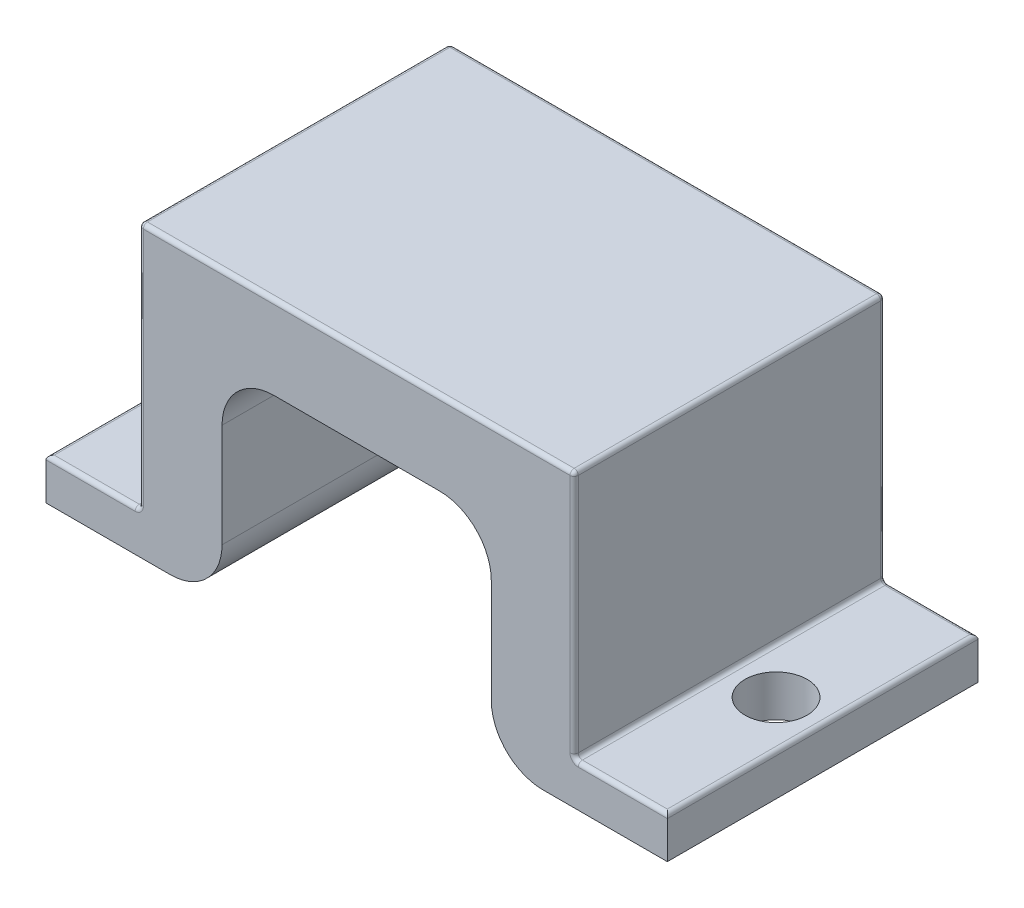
from build123d import *

# Parameters (mm, degrees)
SALIENTE_EXTRUIR1_DEPTH = 15
REDONDEO1_R             = 0.2
CROQUIS2_R              = 1.5
CORTAR_EXTRUIR1_DEPTH   = 15
REDONDEO2_R             = 2.5


with BuildPart() as part:
    # Croquis1 → Saliente-Extruir1 (new body)
    with BuildSketch(Plane.XY):
        Polygon((-10.497326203, 0), (-1.997326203, 0), (-1.997326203, 10), (11.002673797, 10), (11.002673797, 0), (19.502673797, 0), (19.502673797, 2), (15.002673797, 2), (15.002673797, 14), (-5.997326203, 14), (-5.997326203, 2), (-10.497326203, 2), align=None)
    extrude(amount=SALIENTE_EXTRUIR1_DEPTH)

    # Redondeo1
    redondeo1_edges = [part.edges().sort_by_distance(p)[0] for p in [
        (-8.247326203, 2, 0),
        (-5.997326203, 8, 0),
        (4.502673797, 14, 0),
        (15.002673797, 8, 0),
        (17.252673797, 2, 0),
        (-10.497326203, 2, 7.5),
        (-5.997326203, 2, 7.5),
        (-5.997326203, 14, 7.5),
        (15.002673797, 14, 7.5),
        (15.002673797, 2, 7.5),
        (19.502673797, 2, 7.5),
        (17.252673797, 2, 15),
        (15.002673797, 8, 15),
        (4.502673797, 14, 15),
        (-5.997326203, 8, 15),
        (-8.247326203, 2, 15),
    ]]
    fillet(redondeo1_edges, radius=REDONDEO1_R)

    # Croquis2 → Cortar-Extruir1 (cut)
    with BuildSketch(Plane(origin=(0, 2, 0), x_dir=(1, 0, 0), z_dir=(0, 1, 0))):
        with Locations(Location((17.252673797, -7.5, 0), (0, 0, 180))):
            Circle(CROQUIS2_R)
        with Locations(Location((-8.247326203, -7.5, 0), (0, 0, 180))):
            Circle(CROQUIS2_R)
    extrude(amount=-CORTAR_EXTRUIR1_DEPTH, mode=Mode.SUBTRACT)

    # Redondeo2
    redondeo2_edges = [part.edges().sort_by_distance(p)[0] for p in [
        (11.002673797, 0, 7.5),
        (11.002673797, 10, 7.5),
        (-1.997326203, 10, 7.5),
        (-1.997326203, 0, 7.5),
    ]]
    fillet(redondeo2_edges, radius=REDONDEO2_R)


solid = part.part
